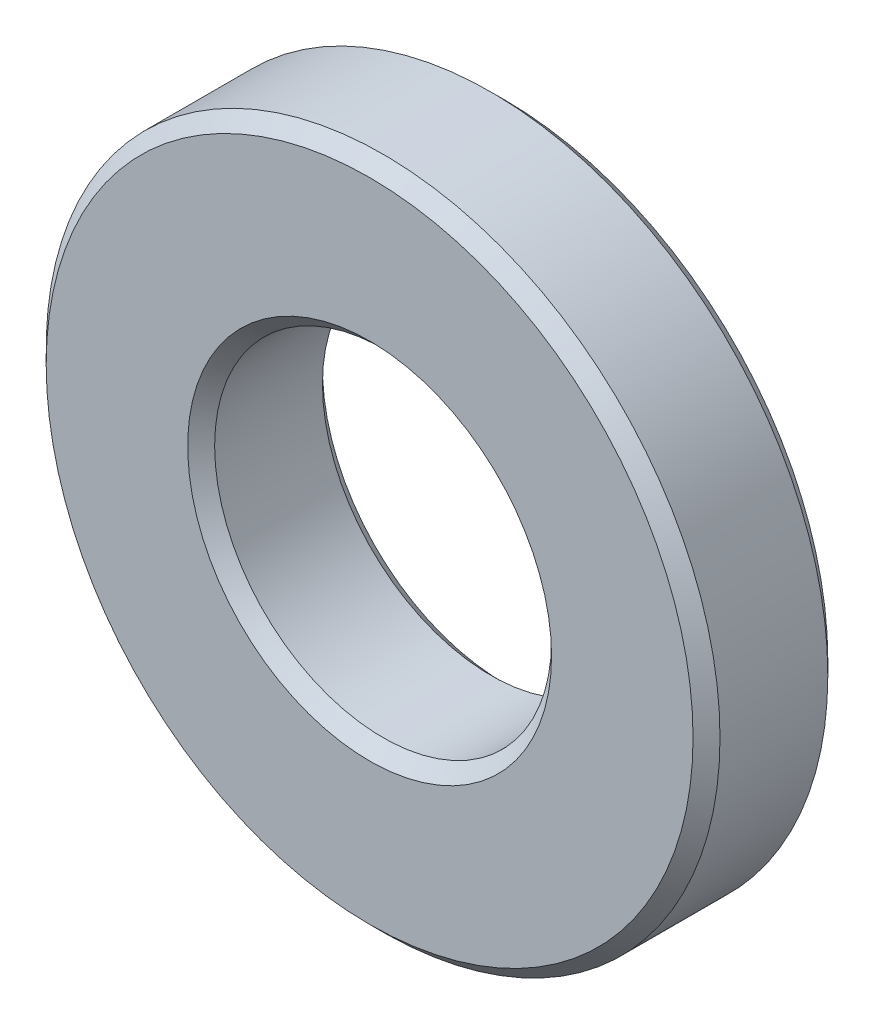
from build123d import *

# Parameters (mm, degrees)
SKETCH1_R           = 2.5
SKETCH1_R_2         = 1.25
BOSS_EXTRUDE2_DEPTH = 0.5
CHAMFER3_SIZE       = 0.1


with BuildPart() as part:
    # Sketch1 → Boss-Extrude2 (new, symmetric)
    with BuildSketch(Plane.XY):
        Circle(SKETCH1_R)
        Circle(SKETCH1_R_2, mode=Mode.SUBTRACT)
    extrude(amount=BOSS_EXTRUDE2_DEPTH, both=True)

    # Chamfer3
    chamfer3_edges = [part.edges().sort_by_distance(p)[0] for p in [
        (-2.5, 0, -0.5),
        (-2.5, 0, 0.5),
        (-1.25, 0, -0.5),
        (-1.25, 0, 0.5),
    ]]
    chamfer(chamfer3_edges, length=CHAMFER3_SIZE)


solid = part.part
